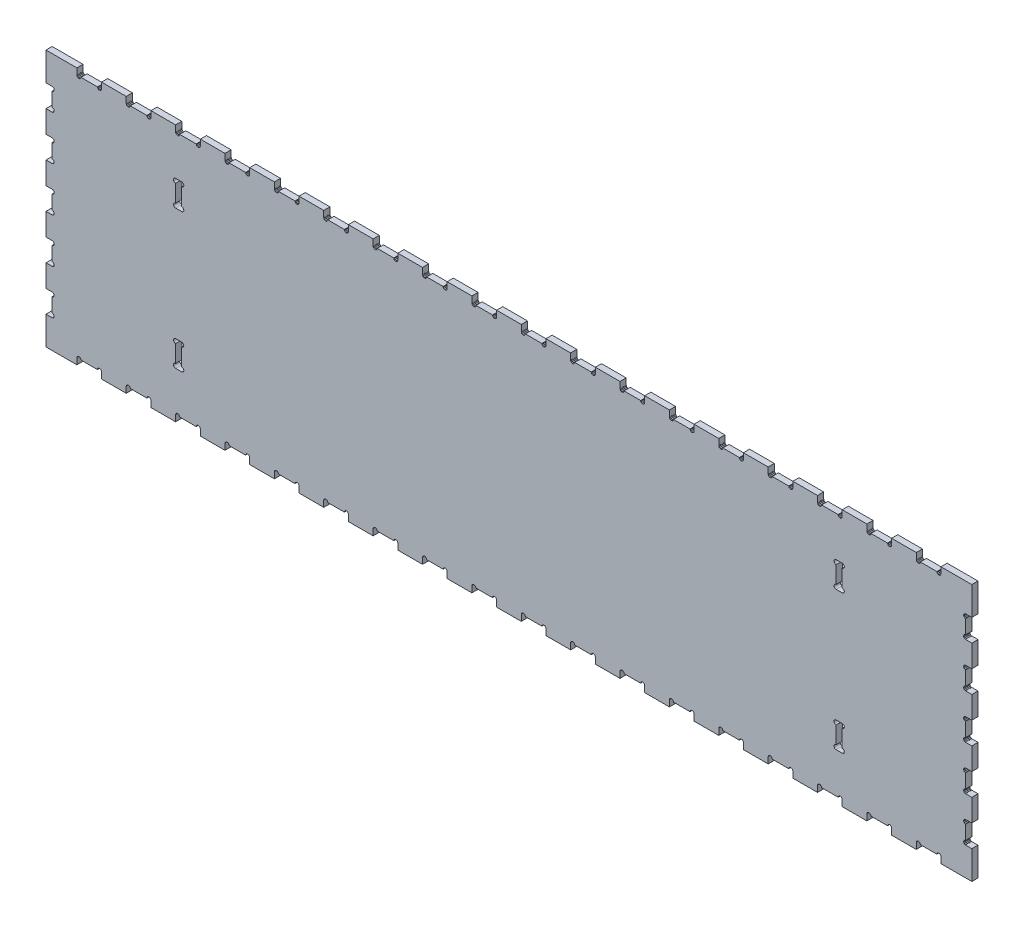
from build123d import *

# Parameters (mm, degrees)
BOSS_EXTRUDE1_DEPTH = 12


with BuildPart() as part:
    # Sketch1 → Boss-Extrude1 (new body)
    with BuildSketch(Plane.XY):
        Polygon((1136, -500), (1136.09, -500), (1136.03, -499.518), (1136.71, -497.728), (1138.14, -496.458), (1140, -496), (1141.86, -496.458), (1143.29, -497.728), (1143.97, -499.518), (1143.91, -500), (1176.09, -500), (1176.03, -499.518), (1176.71, -497.728), (1178.14, -496.458), (1180, -496), (1181.86, -496.458), (1183.29, -497.728), (1183.97, -499.518), (1183.91, -500), (1184, -500), (1184, -512), (1232, -512), (1232, -500), (1232.09, -500), (1232.03, -499.518), (1232.71, -497.728), (1234.14, -496.458), (1236, -496), (1237.86, -496.458), (1239.29, -497.728), (1239.97, -499.518), (1239.91, -500), (1272.09, -500), (1272.03, -499.518), (1272.71, -497.728), (1274.14, -496.458), (1276, -496), (1277.86, -496.458), (1279.29, -497.728), (1279.97, -499.518), (1279.91, -500), (1280, -500), (1280, -512), (1328, -512), (1328, -500), (1328.09, -500), (1328.03, -499.518), (1328.71, -497.728), (1330.14, -496.458), (1332, -496), (1333.86, -496.458), (1335.29, -497.728), (1335.97, -499.518), (1335.91, -500), (1368.09, -500), (1368.03, -499.518), (1368.71, -497.728), (1370.14, -496.458), (1372, -496), (1373.86, -496.458), (1375.29, -497.728), (1375.97, -499.518), (1375.91, -500), (1376, -500), (1376, -512), (1424, -512), (1424, -500), (1424.09, -500), (1424.03, -499.518), (1424.71, -497.728), (1426.14, -496.458), (1428, -496), (1429.86, -496.458), (1431.29, -497.728), (1431.97, -499.518), (1431.91, -500), (1464.09, -500), (1464.03, -499.518), (1464.71, -497.728), (1466.14, -496.458), (1468, -496), (1469.86, -496.458), (1471.29, -497.728), (1471.97, -499.518), (1471.91, -500), (1472, -500), (1472, -512), (1520, -512), (1520, -500), (1520.09, -500), (1520.03, -499.518), (1520.71, -497.728), (1522.14, -496.458), (1524, -496), (1525.86, -496.458), (1527.29, -497.728), (1527.97, -499.518), (1527.91, -500), (1560.09, -500), (1560.03, -499.518), (1560.71, -497.728), (1562.14, -496.458), (1564, -496), (1565.86, -496.458), (1567.29, -497.728), (1567.97, -499.518), (1567.91, -500), (1568, -500), (1568, -512), (1616, -512), (1616, -500), (1616.09, -500), (1616.03, -499.518), (1616.71, -497.728), (1618.14, -496.458), (1620, -496), (1621.86, -496.458), (1623.29, -497.728), (1623.97, -499.518), (1623.91, -500), (1656.09, -500), (1656.03, -499.518), (1656.71, -497.728), (1658.14, -496.458), (1660, -496), (1661.86, -496.458), (1663.29, -497.728), (1663.97, -499.518), (1663.91, -500), (1664, -500), (1664, -512), (1712, -512), (1712, -500), (1712.09, -500), (1712.03, -499.518), (1712.71, -497.728), (1714.14, -496.458), (1716, -496), (1717.86, -496.458), (1719.29, -497.728), (1719.97, -499.518), (1719.91, -500), (1752.09, -500), (1752.03, -499.518), (1752.71, -497.728), (1754.14, -496.458), (1756, -496), (1757.86, -496.458), (1759.29, -497.728), (1759.97, -499.518), (1759.91, -500), (1760, -500), (1760, -512), (1808, -512), (1808, -500), (1808.09, -500), (1808.03, -499.518), (1808.71, -497.728), (1810.14, -496.458), (1812, -496), (1813.86, -496.458), (1815.29, -497.728), (1815.97, -499.518), (1815.91, -500), (1848.09, -500), (1848.03, -499.518), (1848.71, -497.728), (1850.14, -496.458), (1852, -496), (1853.86, -496.458), (1855.29, -497.728), (1855.97, -499.518), (1855.91, -500), (1856, -500), (1856, -512), (1904, -512), (1904, -500), (1904.09, -500), (1904.03, -499.518), (1904.71, -497.728), (1906.14, -496.458), (1908, -496), (1909.86, -496.458), (1911.29, -497.728), (1911.97, -499.518), (1911.91, -500), (1944.09, -500), (1944.03, -499.518), (1944.71, -497.728), (1946.14, -496.458), (1948, -496), (1949.86, -496.458), (1951.29, -497.728), (1951.97, -499.518), (1951.91, -500), (1952, -500), (1952, -512), (2012, -512), (2012, -456.727), (2000, -456.727), (2000, -456.611), (1999.04, -456.611), (1997.35, -455.721), (1996.26, -454.146), (1996.03, -452.245), (1996.71, -450.455), (1998.14, -449.185), (2000, -448.727), (2000, -421.338), (1999.04, -421.338), (1997.35, -420.449), (1996.26, -418.873), (1996.03, -416.972), (1996.71, -415.182), (1998.14, -413.913), (2000, -413.455), (2012, -413.455), (2012, -370.182), (2000, -370.182), (2000, -370.066), (1999.04, -370.066), (1997.35, -369.176), (1996.26, -367.6), (1996.03, -365.7), (1996.71, -363.91), (1998.14, -362.64), (2000, -362.182), (2000, -334.793), (1999.04, -334.793), (1997.35, -333.903), (1996.26, -332.327), (1996.03, -330.427), (1996.71, -328.637), (1998.14, -327.367), (2000, -326.909), (2012, -326.909), (2012, -283.636), (2000, -283.636), (2000, -283.52), (1999.04, -283.52), (1997.35, -282.63), (1996.26, -281.055), (1996.03, -279.154), (1996.71, -277.364), (1998.14, -276.095), (2000, -275.636), (2000, -248.247), (1999.04, -248.247), (1997.35, -247.358), (1996.26, -245.782), (1996.03, -243.882), (1996.71, -242.091), (1998.14, -240.822), (2000, -240.364), (2012, -240.364), (2012, -197.091), (2000, -197.091), (2000, -196.975), (1999.04, -196.975), (1997.35, -196.085), (1996.26, -194.509), (1996.03, -192.609), (1996.71, -190.819), (1998.14, -189.549), (2000, -189.091), (2000, -161.702), (1999.04, -161.702), (1997.35, -160.812), (1996.26, -159.237), (1996.03, -157.336), (1996.71, -155.546), (1998.14, -154.276), (2000, -153.818), (2012, -153.818), (2012, -110.545), (2000, -110.545), (2000, -110.429), (1999.04, -110.429), (1997.35, -109.54), (1996.26, -107.964), (1996.03, -106.063), (1996.71, -104.273), (1998.14, -103.004), (2000, -102.545), (2000, -75.1565), (1999.04, -75.1565), (1997.35, -74.2668), (1996.26, -72.6912), (1996.03, -70.7906), (1996.71, -69.0005), (1998.14, -67.7309), (2000, -67.2728), (2012, -67.2728), (2012, -12), (1952, -12), (1952, -24), (1951.91, -24), (1951.74, -25.4184), (1950.65, -26.9941), (1948.96, -27.8838), (1947.04, -27.8838), (1945.35, -26.9941), (1944.26, -25.4184), (1944.09, -24), (1911.91, -24), (1911.74, -25.4184), (1910.65, -26.9941), (1908.96, -27.8838), (1907.04, -27.8838), (1905.35, -26.9941), (1904.26, -25.4184), (1904.09, -24), (1904, -24), (1904, -12), (1856, -12), (1856, -24), (1855.91, -24), (1855.74, -25.4184), (1854.65, -26.9941), (1852.96, -27.8838), (1851.04, -27.8838), (1849.35, -26.9941), (1848.26, -25.4184), (1848.09, -24), (1815.91, -24), (1815.74, -25.4184), (1814.65, -26.9941), (1812.96, -27.8838), (1811.04, -27.8838), (1809.35, -26.9941), (1808.26, -25.4184), (1808.09, -24), (1808, -24), (1808, -12), (1760, -12), (1760, -24), (1759.91, -24), (1759.74, -25.4184), (1758.65, -26.9941), (1756.96, -27.8838), (1755.04, -27.8838), (1753.35, -26.9941), (1752.26, -25.4184), (1752.09, -24), (1719.91, -24), (1719.74, -25.4184), (1718.65, -26.9941), (1716.96, -27.8838), (1715.04, -27.8838), (1713.35, -26.9941), (1712.26, -25.4184), (1712.09, -24), (1712, -24), (1712, -12), (1664, -12), (1664, -24), (1663.91, -24), (1663.74, -25.4184), (1662.65, -26.9941), (1660.96, -27.8838), (1659.04, -27.8838), (1657.35, -26.9941), (1656.26, -25.4184), (1656.09, -24), (1623.91, -24), (1623.74, -25.4184), (1622.65, -26.9941), (1620.96, -27.8838), (1619.04, -27.8838), (1617.35, -26.9941), (1616.26, -25.4184), (1616.09, -24), (1616, -24), (1616, -12), (1568, -12), (1568, -24), (1567.91, -24), (1567.74, -25.4184), (1566.65, -26.9941), (1564.96, -27.8838), (1563.04, -27.8838), (1561.35, -26.9941), (1560.26, -25.4184), (1560.09, -24), (1527.91, -24), (1527.74, -25.4184), (1526.65, -26.9941), (1524.96, -27.8838), (1523.04, -27.8838), (1521.35, -26.9941), (1520.26, -25.4184), (1520.09, -24), (1520, -24), (1520, -12), (1472, -12), (1472, -24), (1471.91, -24), (1471.74, -25.4184), (1470.65, -26.9941), (1468.96, -27.8838), (1467.04, -27.8838), (1465.35, -26.9941), (1464.26, -25.4184), (1464.09, -24), (1431.91, -24), (1431.74, -25.4184), (1430.65, -26.9941), (1428.96, -27.8838), (1427.04, -27.8838), (1425.35, -26.9941), (1424.26, -25.4184), (1424.09, -24), (1424, -24), (1424, -12), (1376, -12), (1376, -24), (1375.91, -24), (1375.74, -25.4184), (1374.65, -26.9941), (1372.96, -27.8838), (1371.04, -27.8838), (1369.35, -26.9941), (1368.26, -25.4184), (1368.09, -24), (1335.91, -24), (1335.74, -25.4184), (1334.65, -26.9941), (1332.96, -27.8838), (1331.04, -27.8838), (1329.35, -26.9941), (1328.26, -25.4184), (1328.09, -24), (1328, -24), (1328, -12), (1280, -12), (1280, -24), (1279.91, -24), (1279.74, -25.4184), (1278.65, -26.9941), (1276.96, -27.8838), (1275.04, -27.8838), (1273.35, -26.9941), (1272.26, -25.4184), (1272.09, -24), (1239.91, -24), (1239.74, -25.4184), (1238.65, -26.9941), (1236.96, -27.8838), (1235.04, -27.8838), (1233.35, -26.9941), (1232.26, -25.4184), (1232.09, -24), (1232, -24), (1232, -12), (1184, -12), (1184, -24), (1183.91, -24), (1183.74, -25.4184), (1182.65, -26.9941), (1180.96, -27.8838), (1179.04, -27.8838), (1177.35, -26.9941), (1176.26, -25.4184), (1176.09, -24), (1143.91, -24), (1143.74, -25.4184), (1142.65, -26.994), (1140.96, -27.8838), (1139.04, -27.8838), (1137.35, -26.994), (1136.26, -25.4184), (1136.09, -24), (1136, -24), (1136, -12), (1088, -12), (1088, -24), (1087.91, -24), (1087.74, -25.4184), (1086.65, -26.994), (1084.96, -27.8838), (1083.04, -27.8838), (1081.35, -26.994), (1080.26, -25.4184), (1080.09, -24), (1047.91, -24), (1047.74, -25.4184), (1046.65, -26.994), (1044.96, -27.8838), (1043.04, -27.8838), (1041.35, -26.994), (1040.26, -25.4184), (1040.09, -24), (1040, -24), (1040, -12), (992, -12), (992, -24), (991.912, -24), (991.74, -25.4184), (990.652, -26.994), (988.957, -27.8838), (987.043, -27.8838), (985.348, -26.994), (984.26, -25.4184), (984.088, -24), (951.912, -24), (951.74, -25.4184), (950.652, -26.994), (948.957, -27.8838), (947.043, -27.8838), (945.348, -26.994), (944.26, -25.4184), (944.088, -24), (944, -24), (944, -12), (896, -12), (896, -24), (895.912, -24), (895.74, -25.4184), (894.652, -26.994), (892.957, -27.8838), (891.043, -27.8838), (889.348, -26.994), (888.26, -25.4184), (888.088, -24), (855.912, -24), (855.74, -25.4184), (854.652, -26.994), (852.957, -27.8838), (851.043, -27.8838), (849.348, -26.994), (848.26, -25.4184), (848.088, -24), (848, -24), (848, -12), (800, -12), (800, -24), (799.912, -24), (799.74, -25.4184), (798.652, -26.994), (796.957, -27.8838), (795.043, -27.8838), (793.348, -26.994), (792.26, -25.4184), (792.088, -24), (759.912, -24), (759.74, -25.4184), (758.652, -26.994), (756.957, -27.8838), (755.043, -27.8838), (753.348, -26.994), (752.26, -25.4184), (752.088, -24), (752, -24), (752, -12), (704, -12), (704, -24), (703.912, -24), (703.74, -25.4184), (702.652, -26.994), (700.957, -27.8838), (699.043, -27.8838), (697.348, -26.994), (696.26, -25.4184), (696.088, -24), (663.912, -24), (663.74, -25.4184), (662.652, -26.994), (660.957, -27.8838), (659.043, -27.8838), (657.348, -26.994), (656.26, -25.4184), (656.088, -24), (656, -24), (656, -12), (608, -12), (608, -24), (607.912, -24), (607.74, -25.4184), (606.652, -26.994), (604.957, -27.8838), (603.043, -27.8838), (601.348, -26.994), (600.26, -25.4184), (600.088, -24), (567.912, -24), (567.74, -25.4184), (566.652, -26.994), (564.957, -27.8838), (563.043, -27.8838), (561.348, -26.994), (560.26, -25.4184), (560.088, -24), (560, -24), (560, -12), (512, -12), (512, -24), (511.912, -24), (511.74, -25.4184), (510.652, -26.994), (508.957, -27.8838), (507.043, -27.8838), (505.348, -26.994), (504.26, -25.4184), (504.088, -24), (471.912, -24), (471.74, -25.4184), (470.652, -26.994), (468.957, -27.8838), (467.043, -27.8838), (465.348, -26.994), (464.26, -25.4184), (464.088, -24), (464, -24), (464, -12), (416, -12), (416, -24), (415.912, -24), (415.74, -25.4184), (414.652, -26.994), (412.957, -27.8838), (411.043, -27.8838), (409.348, -26.994), (408.26, -25.4184), (408.088, -24), (375.912, -24), (375.74, -25.4184), (374.652, -26.994), (372.957, -27.8838), (371.043, -27.8838), (369.348, -26.994), (368.26, -25.4184), (368.088, -24), (368, -24), (368, -12), (320, -12), (320, -24), (319.912, -24), (319.74, -25.4184), (318.652, -26.994), (316.957, -27.8838), (315.043, -27.8838), (313.348, -26.994), (312.26, -25.4184), (312.088, -24), (279.912, -24), (279.74, -25.4184), (278.652, -26.994), (276.957, -27.8838), (275.043, -27.8838), (273.348, -26.994), (272.26, -25.4184), (272.088, -24), (272, -24), (272, -12), (212, -12), (212, -67.2727), (224, -67.2727), (225.859, -67.7309), (227.292, -69.0005), (227.971, -70.7906), (227.74, -72.6911), (226.652, -74.2668), (224.957, -75.1565), (224, -75.1565), (224, -102.545), (225.859, -103.004), (227.292, -104.273), (227.971, -106.063), (227.74, -107.964), (226.652, -109.54), (224.957, -110.429), (224, -110.429), (224, -110.545), (212, -110.545), (212, -153.818), (224, -153.818), (225.859, -154.276), (227.292, -155.546), (227.971, -157.336), (227.74, -159.237), (226.652, -160.812), (224.957, -161.702), (224, -161.702), (224, -189.091), (225.859, -189.549), (227.292, -190.819), (227.971, -192.609), (227.74, -194.509), (226.652, -196.085), (224.957, -196.975), (224, -196.975), (224, -197.091), (212, -197.091), (212, -240.364), (224, -240.364), (225.859, -240.822), (227.292, -242.091), (227.971, -243.882), (227.74, -245.782), (226.652, -247.358), (224.957, -248.247), (224, -248.247), (224, -275.636), (225.859, -276.095), (227.292, -277.364), (227.971, -279.154), (227.74, -281.055), (226.652, -282.63), (224.957, -283.52), (224, -283.52), (224, -283.636), (212, -283.636), (212, -326.909), (224, -326.909), (225.859, -327.367), (227.292, -328.637), (227.971, -330.427), (227.74, -332.327), (226.652, -333.903), (224.957, -334.793), (224, -334.793), (224, -362.182), (225.859, -362.64), (227.292, -363.91), (227.971, -365.7), (227.74, -367.6), (226.652, -369.176), (224.957, -370.066), (224, -370.066), (224, -370.182), (212, -370.182), (212, -413.455), (224, -413.455), (225.859, -413.913), (227.292, -415.182), (227.971, -416.972), (227.74, -418.873), (226.652, -420.449), (224.957, -421.338), (224, -421.338), (224, -448.727), (225.859, -449.185), (227.292, -450.455), (227.971, -452.245), (227.74, -454.146), (226.652, -455.721), (224.957, -456.611), (224, -456.611), (224, -456.727), (212, -456.727), (212, -512), (272, -512), (272, -500), (272.088, -500), (272.029, -499.518), (272.708, -497.728), (274.141, -496.458), (276, -496), (277.859, -496.458), (279.292, -497.728), (279.971, -499.518), (279.912, -500), (312.088, -500), (312.029, -499.518), (312.708, -497.728), (314.141, -496.458), (316, -496), (317.859, -496.458), (319.292, -497.728), (319.971, -499.518), (319.912, -500), (320, -500), (320, -512), (368, -512), (368, -500), (368.088, -500), (368.029, -499.518), (368.708, -497.728), (370.141, -496.458), (372, -496), (373.859, -496.458), (375.292, -497.728), (375.971, -499.518), (375.912, -500), (408.088, -500), (408.029, -499.518), (408.708, -497.728), (410.141, -496.458), (412, -496), (413.859, -496.458), (415.292, -497.728), (415.971, -499.518), (415.912, -500), (416, -500), (416, -512), (464, -512), (464, -500), (464.088, -500), (464.029, -499.518), (464.708, -497.728), (466.141, -496.458), (468, -496), (469.859, -496.458), (471.292, -497.728), (471.971, -499.518), (471.912, -500), (504.088, -500), (504.029, -499.518), (504.708, -497.728), (506.141, -496.458), (508, -496), (509.859, -496.458), (511.292, -497.728), (511.971, -499.518), (511.912, -500), (512, -500), (512, -512), (560, -512), (560, -500), (560.088, -500), (560.029, -499.518), (560.708, -497.728), (562.141, -496.458), (564, -496), (565.859, -496.458), (567.292, -497.728), (567.971, -499.518), (567.912, -500), (600.088, -500), (600.029, -499.518), (600.708, -497.728), (602.141, -496.458), (604, -496), (605.859, -496.458), (607.292, -497.728), (607.971, -499.518), (607.912, -500), (608, -500), (608, -512), (656, -512), (656, -500), (656.088, -500), (656.029, -499.518), (656.708, -497.728), (658.141, -496.458), (660, -496), (661.859, -496.458), (663.292, -497.728), (663.971, -499.518), (663.912, -500), (696.088, -500), (696.029, -499.518), (696.708, -497.728), (698.141, -496.458), (700, -496), (701.859, -496.458), (703.292, -497.728), (703.971, -499.518), (703.912, -500), (704, -500), (704, -512), (752, -512), (752, -500), (752.088, -500), (752.029, -499.518), (752.708, -497.728), (754.141, -496.458), (756, -496), (757.859, -496.458), (759.292, -497.728), (759.971, -499.518), (759.912, -500), (792.088, -500), (792.029, -499.518), (792.708, -497.728), (794.141, -496.458), (796, -496), (797.859, -496.458), (799.292, -497.728), (799.971, -499.518), (799.912, -500), (800, -500), (800, -512), (848, -512), (848, -500), (848.088, -500), (848.029, -499.518), (848.708, -497.728), (850.141, -496.458), (852, -496), (853.859, -496.458), (855.292, -497.728), (855.971, -499.518), (855.912, -500), (888.088, -500), (888.029, -499.518), (888.708, -497.728), (890.141, -496.458), (892, -496), (893.859, -496.458), (895.292, -497.728), (895.971, -499.518), (895.912, -500), (896, -500), (896, -512), (944, -512), (944, -500), (944.088, -500), (944.029, -499.518), (944.708, -497.728), (946.141, -496.458), (948, -496), (949.859, -496.458), (951.292, -497.728), (951.971, -499.518), (951.912, -500), (984.088, -500), (984.029, -499.518), (984.708, -497.728), (986.141, -496.458), (988, -496), (989.859, -496.458), (991.292, -497.728), (991.971, -499.518), (991.912, -500), (992, -500), (992, -512), (1040, -512), (1040, -500), (1040.09, -500), (1040.03, -499.518), (1040.71, -497.728), (1042.14, -496.458), (1044, -496), (1045.86, -496.458), (1047.29, -497.728), (1047.97, -499.518), (1047.91, -500), (1080.09, -500), (1080.03, -499.518), (1080.71, -497.728), (1082.14, -496.458), (1084, -496), (1085.86, -496.458), (1087.29, -497.728), (1087.97, -499.518), (1087.91, -500), (1088, -500), (1088, -512), (1136, -512), align=None)
        with BuildLine():
            Line((475.8, -143.8), (475.8, -110.2))
            ThreePointArc((475.8, -110.2), (479.9, -106.1), (475.8, -102))
            Line((475.8, -102), (464, -102))
            ThreePointArc((464, -102), (459.9, -106.1), (464, -110.2))
            Line((464, -110.2), (464, -143.8))
            ThreePointArc((464, -143.8), (459.9, -147.9), (464, -152))
            Line((464, -152), (475.8, -152))
            ThreePointArc((475.8, -152), (479.9, -147.9), (475.8, -143.8))
        make_face(mode=Mode.SUBTRACT)
        with BuildLine():
            Line((464, -371.883), (475.8, -371.883))
            ThreePointArc((475.8, -371.883), (479.9, -375.983), (475.8, -380.083))
            Line((475.8, -380.083), (475.8, -413.683))
            ThreePointArc((475.8, -413.683), (479.9, -417.783), (475.8, -421.883))
            Line((475.8, -421.883), (464, -421.883))
            ThreePointArc((464, -421.883), (459.9, -417.783), (464, -413.683))
            Line((464, -413.683), (464, -380.083))
            ThreePointArc((464, -380.083), (459.9, -375.983), (464, -371.883))
        make_face(mode=Mode.SUBTRACT)
        with BuildLine():
            Line((1760, -152), (1748.2, -152))
            ThreePointArc((1748.2, -152), (1744.1, -147.9), (1748.2, -143.8))
            Line((1748.2, -143.8), (1748.2, -110.2))
            ThreePointArc((1748.2, -110.2), (1744.1, -106.1), (1748.2, -102))
            Line((1748.2, -102), (1760, -102))
            ThreePointArc((1760, -102), (1764.1, -106.1), (1760, -110.2))
            Line((1760, -110.2), (1760, -143.8))
            ThreePointArc((1760, -143.8), (1764.1, -147.9), (1760, -152))
        make_face(mode=Mode.SUBTRACT)
        with BuildLine():
            Line((1748.2, -380.083), (1748.2, -413.683))
            ThreePointArc((1748.2, -413.683), (1744.1, -417.783), (1748.2, -421.883))
            Line((1748.2, -421.883), (1760, -421.883))
            ThreePointArc((1760, -421.883), (1764.1, -417.783), (1760, -413.683))
            Line((1760, -413.683), (1760, -380.083))
            ThreePointArc((1760, -380.083), (1764.1, -375.983), (1760, -371.883))
            Line((1760, -371.883), (1748.2, -371.883))
            ThreePointArc((1748.2, -371.883), (1744.1, -375.983), (1748.2, -380.083))
        make_face(mode=Mode.SUBTRACT)
    extrude(amount=BOSS_EXTRUDE1_DEPTH)


solid = part.part
